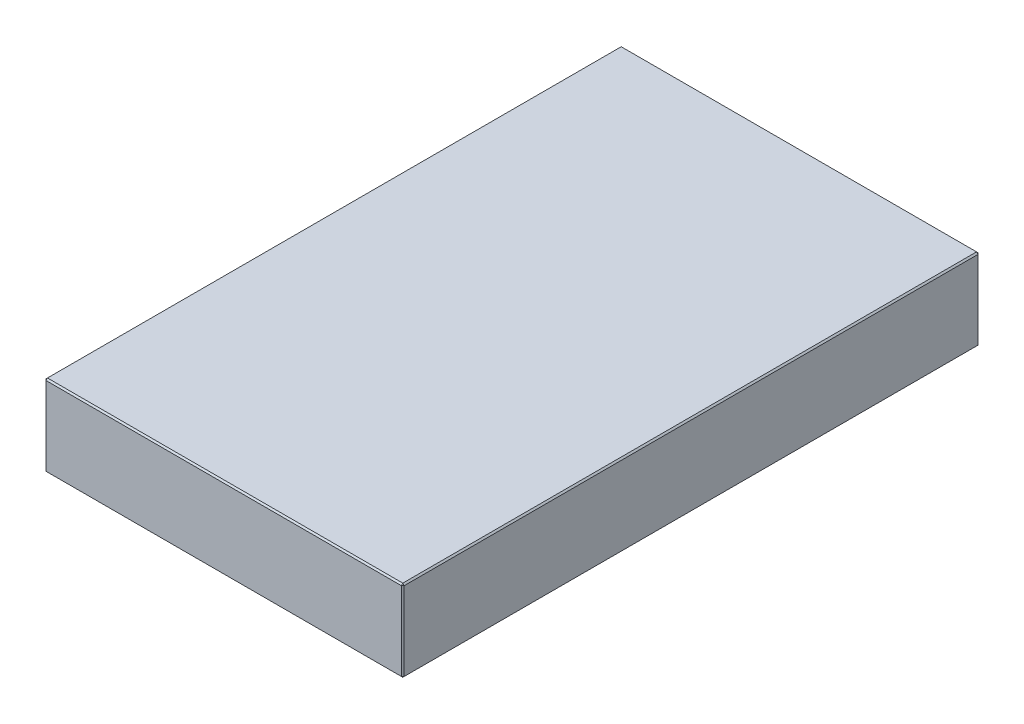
ISO-10303-21;
HEADER;
FILE_DESCRIPTION(('STEP AP214'),'2;1');
FILE_NAME('part.step','',(''),(''),'','','');
FILE_SCHEMA(('AUTOMOTIVE_DESIGN { 1 0 10303 214 1 1 1 1 }'));
ENDSEC;
DATA;
#1=APPLICATION_CONTEXT('core data for automotive mechanical design processes');
#2=APPLICATION_PROTOCOL_DEFINITION('international standard','automotive_design',2000,#1);
#3=PRODUCT_CONTEXT('',#1,'mechanical');
#4=PRODUCT('Part','Part','',(#3));
#5=PRODUCT_RELATED_PRODUCT_CATEGORY('part','',(#4));
#6=PRODUCT_DEFINITION_FORMATION('','',#4);
#7=PRODUCT_DEFINITION_CONTEXT('part definition',#1,'design');
#8=PRODUCT_DEFINITION('design','',#6,#7);
#9=PRODUCT_DEFINITION_SHAPE('','',#8);
#10=(LENGTH_UNIT() NAMED_UNIT(*) SI_UNIT(.MILLI.,.METRE.));
#11=(NAMED_UNIT(*) PLANE_ANGLE_UNIT() SI_UNIT($,.RADIAN.));
#12=(NAMED_UNIT(*) SI_UNIT($,.STERADIAN.) SOLID_ANGLE_UNIT());
#13=UNCERTAINTY_MEASURE_WITH_UNIT(LENGTH_MEASURE(1.E-05),#10,'distance_accuracy_value','');
#14=(GEOMETRIC_REPRESENTATION_CONTEXT(3) GLOBAL_UNCERTAINTY_ASSIGNED_CONTEXT((#13)) GLOBAL_UNIT_ASSIGNED_CONTEXT((#10,
#11,#12)) REPRESENTATION_CONTEXT('',''));
#15=CARTESIAN_POINT('',(0.,0.,0.));
#16=DIRECTION('',(0.,0.,1.));
#17=DIRECTION('',(1.,0.,0.));
#18=AXIS2_PLACEMENT_3D('',#15,#16,#17);
#19=CARTESIAN_POINT('',(-123.,56.,198.));
#20=DIRECTION('',(1.,0.,0.));
#21=DIRECTION('',(0.,0.,-1.));
#22=AXIS2_PLACEMENT_3D('',#19,#20,#21);
#23=PLANE('',#22);
#24=DIRECTION('',(0.,-1.,0.));
#25=VECTOR('',#24,1.);
#26=CARTESIAN_POINT('',(-123.,56.,-197.));
#27=LINE('',#26,#25);
#28=CARTESIAN_POINT('',(-123.,55.,-197.));
#29=VERTEX_POINT('',#28);
#30=CARTESIAN_POINT('',(-123.,1.00000000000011,-197.));
#31=VERTEX_POINT('',#30);
#32=EDGE_CURVE('E114',#29,#31,#27,.T.);
#33=ORIENTED_EDGE('',*,*,#32,.T.);
#34=DIRECTION('',(0.,0.,1.));
#35=VECTOR('',#34,1.);
#36=CARTESIAN_POINT('',(-123.,1.00000000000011,198.));
#37=LINE('',#36,#35);
#38=CARTESIAN_POINT('',(-123.,1.00000000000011,197.));
#39=VERTEX_POINT('',#38);
#40=EDGE_CURVE('E110',#31,#39,#37,.T.);
#41=ORIENTED_EDGE('',*,*,#40,.T.);
#42=DIRECTION('',(0.,1.,0.));
#43=VECTOR('',#42,1.);
#44=CARTESIAN_POINT('',(-123.,56.,197.));
#45=LINE('',#44,#43);
#46=CARTESIAN_POINT('',(-123.,55.,197.));
#47=VERTEX_POINT('',#46);
#48=EDGE_CURVE('E103',#39,#47,#45,.T.);
#49=ORIENTED_EDGE('',*,*,#48,.T.);
#50=DIRECTION('',(0.,0.,-1.));
#51=VECTOR('',#50,1.);
#52=CARTESIAN_POINT('',(-123.,55.,-198.));
#53=LINE('',#52,#51);
#54=EDGE_CURVE('E107',#47,#29,#53,.T.);
#55=ORIENTED_EDGE('',*,*,#54,.T.);
#56=EDGE_LOOP('',(#33,#41,#49,#55));
#57=FACE_BOUND('',#56,.T.);
#58=ADVANCED_FACE('F15',(#57),#23,.F.);
#59=CARTESIAN_POINT('',(123.,56.,198.));
#60=DIRECTION('',(0.,0.,-1.));
#61=DIRECTION('',(-1.,0.,0.));
#62=AXIS2_PLACEMENT_3D('',#59,#60,#61);
#63=PLANE('',#62);
#64=DIRECTION('',(-1.,0.,0.));
#65=VECTOR('',#64,1.);
#66=CARTESIAN_POINT('',(-123.,55.,198.));
#67=LINE('',#66,#65);
#68=CARTESIAN_POINT('',(122.,55.,198.));
#69=VERTEX_POINT('',#68);
#70=CARTESIAN_POINT('',(-122.,55.,198.));
#71=VERTEX_POINT('',#70);
#72=EDGE_CURVE('E164',#69,#71,#67,.T.);
#73=ORIENTED_EDGE('',*,*,#72,.T.);
#74=DIRECTION('',(0.,-1.,0.));
#75=VECTOR('',#74,1.);
#76=CARTESIAN_POINT('',(-122.,56.,198.));
#77=LINE('',#76,#75);
#78=CARTESIAN_POINT('',(-122.,1.00000000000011,198.));
#79=VERTEX_POINT('',#78);
#80=EDGE_CURVE('E122',#71,#79,#77,.T.);
#81=ORIENTED_EDGE('',*,*,#80,.T.);
#82=DIRECTION('',(1.,0.,0.));
#83=VECTOR('',#82,1.);
#84=CARTESIAN_POINT('',(123.,1.00000000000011,198.));
#85=LINE('',#84,#83);
#86=CARTESIAN_POINT('',(122.,1.00000000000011,198.));
#87=VERTEX_POINT('',#86);
#88=EDGE_CURVE('E168',#79,#87,#85,.T.);
#89=ORIENTED_EDGE('',*,*,#88,.T.);
#90=DIRECTION('',(0.,1.,0.));
#91=VECTOR('',#90,1.);
#92=CARTESIAN_POINT('',(122.,56.,198.));
#93=LINE('',#92,#91);
#94=EDGE_CURVE('E166',#87,#69,#93,.T.);
#95=ORIENTED_EDGE('',*,*,#94,.T.);
#96=EDGE_LOOP('',(#73,#81,#89,#95));
#97=FACE_BOUND('',#96,.T.);
#98=ADVANCED_FACE('F275',(#97),#63,.F.);
#99=CARTESIAN_POINT('',(123.,56.,198.));
#100=DIRECTION('',(-1.,0.,0.));
#101=DIRECTION('',(0.,0.,1.));
#102=AXIS2_PLACEMENT_3D('',#99,#100,#101);
#103=PLANE('',#102);
#104=DIRECTION('',(0.,0.,-1.));
#105=VECTOR('',#104,1.);
#106=CARTESIAN_POINT('',(123.,1.00000000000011,198.));
#107=LINE('',#106,#105);
#108=CARTESIAN_POINT('',(123.,1.00000000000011,197.));
#109=VERTEX_POINT('',#108);
#110=CARTESIAN_POINT('',(123.,1.00000000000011,-197.));
#111=VERTEX_POINT('',#110);
#112=EDGE_CURVE('E159',#109,#111,#107,.T.);
#113=ORIENTED_EDGE('',*,*,#112,.T.);
#114=DIRECTION('',(0.,1.,0.));
#115=VECTOR('',#114,1.);
#116=CARTESIAN_POINT('',(123.,56.,-197.));
#117=LINE('',#116,#115);
#118=CARTESIAN_POINT('',(123.,55.,-197.));
#119=VERTEX_POINT('',#118);
#120=EDGE_CURVE('E161',#111,#119,#117,.T.);
#121=ORIENTED_EDGE('',*,*,#120,.T.);
#122=DIRECTION('',(0.,0.,1.));
#123=VECTOR('',#122,1.);
#124=CARTESIAN_POINT('',(123.,55.,198.));
#125=LINE('',#124,#123);
#126=CARTESIAN_POINT('',(123.,55.,197.));
#127=VERTEX_POINT('',#126);
#128=EDGE_CURVE('E155',#119,#127,#125,.T.);
#129=ORIENTED_EDGE('',*,*,#128,.T.);
#130=DIRECTION('',(0.,-1.,0.));
#131=VECTOR('',#130,1.);
#132=CARTESIAN_POINT('',(123.,56.,197.));
#133=LINE('',#132,#131);
#134=EDGE_CURVE('E157',#127,#109,#133,.T.);
#135=ORIENTED_EDGE('',*,*,#134,.T.);
#136=EDGE_LOOP('',(#113,#121,#129,#135));
#137=FACE_BOUND('',#136,.T.);
#138=ADVANCED_FACE('F254',(#137),#103,.F.);
#139=CARTESIAN_POINT('',(123.,56.,-198.));
#140=DIRECTION('',(0.,0.,1.));
#141=DIRECTION('',(1.,0.,0.));
#142=AXIS2_PLACEMENT_3D('',#139,#140,#141);
#143=PLANE('',#142);
#144=DIRECTION('',(0.,-1.,0.));
#145=VECTOR('',#144,1.);
#146=CARTESIAN_POINT('',(122.,56.,-198.));
#147=LINE('',#146,#145);
#148=CARTESIAN_POINT('',(122.,55.,-198.));
#149=VERTEX_POINT('',#148);
#150=CARTESIAN_POINT('',(122.,1.00000000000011,-198.));
#151=VERTEX_POINT('',#150);
#152=EDGE_CURVE('E148',#149,#151,#147,.T.);
#153=ORIENTED_EDGE('',*,*,#152,.T.);
#154=DIRECTION('',(-1.,0.,0.));
#155=VECTOR('',#154,1.);
#156=CARTESIAN_POINT('',(123.,1.00000000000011,-198.));
#157=LINE('',#156,#155);
#158=CARTESIAN_POINT('',(-122.,1.00000000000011,-198.));
#159=VERTEX_POINT('',#158);
#160=EDGE_CURVE('E153',#151,#159,#157,.T.);
#161=ORIENTED_EDGE('',*,*,#160,.T.);
#162=DIRECTION('',(0.,1.,0.));
#163=VECTOR('',#162,1.);
#164=CARTESIAN_POINT('',(-122.,56.,-198.));
#165=LINE('',#164,#163);
#166=CARTESIAN_POINT('',(-122.,55.,-198.));
#167=VERTEX_POINT('',#166);
#168=EDGE_CURVE('E150',#159,#167,#165,.T.);
#169=ORIENTED_EDGE('',*,*,#168,.T.);
#170=DIRECTION('',(1.,0.,0.));
#171=VECTOR('',#170,1.);
#172=CARTESIAN_POINT('',(123.,55.,-198.));
#173=LINE('',#172,#171);
#174=EDGE_CURVE('E146',#167,#149,#173,.T.);
#175=ORIENTED_EDGE('',*,*,#174,.T.);
#176=EDGE_LOOP('',(#153,#161,#169,#175));
#177=FACE_BOUND('',#176,.T.);
#178=ADVANCED_FACE('F284',(#177),#143,.F.);
#179=CARTESIAN_POINT('',(0.,56.,0.));
#180=DIRECTION('',(0.,1.,0.));
#181=DIRECTION('',(0.,0.,1.));
#182=AXIS2_PLACEMENT_3D('',#179,#180,#181);
#183=PLANE('',#182);
#184=DIRECTION('',(0.,0.,-1.));
#185=VECTOR('',#184,1.);
#186=CARTESIAN_POINT('',(122.,56.,-198.));
#187=LINE('',#186,#185);
#188=CARTESIAN_POINT('',(122.,56.,197.));
#189=VERTEX_POINT('',#188);
#190=CARTESIAN_POINT('',(122.,56.,-197.));
#191=VERTEX_POINT('',#190);
#192=EDGE_CURVE('E24',#189,#191,#187,.T.);
#193=ORIENTED_EDGE('',*,*,#192,.T.);
#194=DIRECTION('',(-1.,0.,0.));
#195=VECTOR('',#194,1.);
#196=CARTESIAN_POINT('',(-123.,56.,-197.));
#197=LINE('',#196,#195);
#198=CARTESIAN_POINT('',(-122.,56.,-197.));
#199=VERTEX_POINT('',#198);
#200=EDGE_CURVE('E9',#191,#199,#197,.T.);
#201=ORIENTED_EDGE('',*,*,#200,.T.);
#202=DIRECTION('',(0.,0.,1.));
#203=VECTOR('',#202,1.);
#204=CARTESIAN_POINT('',(-122.,56.,198.));
#205=LINE('',#204,#203);
#206=CARTESIAN_POINT('',(-122.,56.,197.));
#207=VERTEX_POINT('',#206);
#208=EDGE_CURVE('E180',#199,#207,#205,.T.);
#209=ORIENTED_EDGE('',*,*,#208,.T.);
#210=DIRECTION('',(1.,0.,0.));
#211=VECTOR('',#210,1.);
#212=CARTESIAN_POINT('',(123.,56.,197.));
#213=LINE('',#212,#211);
#214=EDGE_CURVE('E35',#207,#189,#213,.T.);
#215=ORIENTED_EDGE('',*,*,#214,.T.);
#216=EDGE_LOOP('',(#193,#201,#209,#215));
#217=FACE_BOUND('',#216,.T.);
#218=ADVANCED_FACE('F350',(#217),#183,.T.);
#219=CARTESIAN_POINT('',(0.,0.,0.));
#220=DIRECTION('',(0.,1.,0.));
#221=DIRECTION('',(0.,0.,1.));
#222=AXIS2_PLACEMENT_3D('',#219,#220,#221);
#223=PLANE('',#222);
#224=DIRECTION('',(0.,0.,1.));
#225=VECTOR('',#224,1.);
#226=CARTESIAN_POINT('',(122.,0.,0.));
#227=LINE('',#226,#225);
#228=CARTESIAN_POINT('',(122.,0.,-197.));
#229=VERTEX_POINT('',#228);
#230=CARTESIAN_POINT('',(122.,0.,197.));
#231=VERTEX_POINT('',#230);
#232=EDGE_CURVE('E171',#229,#231,#227,.T.);
#233=ORIENTED_EDGE('',*,*,#232,.T.);
#234=DIRECTION('',(-1.,0.,0.));
#235=VECTOR('',#234,1.);
#236=CARTESIAN_POINT('',(0.,0.,197.));
#237=LINE('',#236,#235);
#238=CARTESIAN_POINT('',(-122.,0.,197.));
#239=VERTEX_POINT('',#238);
#240=EDGE_CURVE('E177',#231,#239,#237,.T.);
#241=ORIENTED_EDGE('',*,*,#240,.T.);
#242=DIRECTION('',(0.,0.,-1.));
#243=VECTOR('',#242,1.);
#244=CARTESIAN_POINT('',(-122.,0.,0.));
#245=LINE('',#244,#243);
#246=CARTESIAN_POINT('',(-122.,0.,-197.));
#247=VERTEX_POINT('',#246);
#248=EDGE_CURVE('E175',#239,#247,#245,.T.);
#249=ORIENTED_EDGE('',*,*,#248,.T.);
#250=DIRECTION('',(1.,0.,0.));
#251=VECTOR('',#250,1.);
#252=CARTESIAN_POINT('',(0.,0.,-197.));
#253=LINE('',#252,#251);
#254=EDGE_CURVE('E173',#247,#229,#253,.T.);
#255=ORIENTED_EDGE('',*,*,#254,.T.);
#256=EDGE_LOOP('',(#233,#241,#249,#255));
#257=FACE_BOUND('',#256,.T.);
#258=ADVANCED_FACE('F246',(#257),#223,.F.);
#259=CARTESIAN_POINT('',(123.,56.,197.));
#260=DIRECTION('',(-0.707106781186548,0.,-0.707106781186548));
#261=DIRECTION('',(0.,-1.,0.));
#262=AXIS2_PLACEMENT_3D('',#259,#260,#261);
#263=PLANE('',#262);
#264=DIRECTION('',(-0.707106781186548,0.,0.707106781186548));
#265=VECTOR('',#264,1.);
#266=CARTESIAN_POINT('',(122.,55.,198.));
#267=LINE('',#266,#265);
#268=EDGE_CURVE('E19',#69,#127,#267,.F.);
#269=ORIENTED_EDGE('',*,*,#268,.F.);
#270=ORIENTED_EDGE('',*,*,#94,.F.);
#271=DIRECTION('',(0.707106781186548,0.,-0.707106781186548));
#272=VECTOR('',#271,1.);
#273=CARTESIAN_POINT('',(122.,1.00000000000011,198.));
#274=LINE('',#273,#272);
#275=EDGE_CURVE('E142',#109,#87,#274,.F.);
#276=ORIENTED_EDGE('',*,*,#275,.F.);
#277=ORIENTED_EDGE('',*,*,#134,.F.);
#278=EDGE_LOOP('',(#269,#270,#276,#277));
#279=FACE_BOUND('',#278,.T.);
#280=ADVANCED_FACE('F17',(#279),#263,.F.);
#281=CARTESIAN_POINT('',(122.,55.,198.));
#282=DIRECTION('',(0.577350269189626,0.577350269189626,0.577350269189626));
#283=DIRECTION('',(0.707106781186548,0.,-0.707106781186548));
#284=AXIS2_PLACEMENT_3D('',#281,#282,#283);
#285=PLANE('',#284);
#286=DIRECTION('',(0.,-0.707106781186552,0.707106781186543));
#287=VECTOR('',#286,1.);
#288=CARTESIAN_POINT('',(122.,55.,198.));
#289=LINE('',#288,#287);
#290=EDGE_CURVE('E226',#69,#189,#289,.F.);
#291=ORIENTED_EDGE('',*,*,#290,.F.);
#292=ORIENTED_EDGE('',*,*,#268,.T.);
#293=DIRECTION('',(-0.707106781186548,0.707106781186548,0.));
#294=VECTOR('',#293,1.);
#295=CARTESIAN_POINT('',(122.5,55.5,197.));
#296=LINE('',#295,#294);
#297=EDGE_CURVE('E228',#189,#127,#296,.F.);
#298=ORIENTED_EDGE('',*,*,#297,.F.);
#299=EDGE_LOOP('',(#291,#292,#298));
#300=FACE_BOUND('',#299,.T.);
#301=ADVANCED_FACE('F270',(#300),#285,.T.);
#302=CARTESIAN_POINT('',(122.,1.00000000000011,198.));
#303=DIRECTION('',(0.577350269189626,-0.577350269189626,0.577350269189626));
#304=DIRECTION('',(0.707106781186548,0.,-0.707106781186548));
#305=AXIS2_PLACEMENT_3D('',#302,#303,#304);
#306=PLANE('',#305);
#307=DIRECTION('',(-0.707106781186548,-0.707106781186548,0.));
#308=VECTOR('',#307,1.);
#309=CARTESIAN_POINT('',(122.5,0.500000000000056,197.));
#310=LINE('',#309,#308);
#311=EDGE_CURVE('E220',#109,#231,#310,.T.);
#312=ORIENTED_EDGE('',*,*,#311,.F.);
#313=ORIENTED_EDGE('',*,*,#275,.T.);
#314=DIRECTION('',(0.,0.707106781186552,0.707106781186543));
#315=VECTOR('',#314,1.);
#316=CARTESIAN_POINT('',(122.,1.00000000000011,198.));
#317=LINE('',#316,#315);
#318=EDGE_CURVE('E223',#231,#87,#317,.T.);
#319=ORIENTED_EDGE('',*,*,#318,.F.);
#320=EDGE_LOOP('',(#312,#313,#319));
#321=FACE_BOUND('',#320,.T.);
#322=ADVANCED_FACE('F235',(#321),#306,.T.);
#323=CARTESIAN_POINT('',(122.,56.,0.));
#324=DIRECTION('',(0.707106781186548,0.707106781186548,0.));
#325=DIRECTION('',(0.,0.,1.));
#326=AXIS2_PLACEMENT_3D('',#323,#324,#325);
#327=PLANE('',#326);
#328=ORIENTED_EDGE('',*,*,#297,.T.);
#329=ORIENTED_EDGE('',*,*,#128,.F.);
#330=DIRECTION('',(0.707106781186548,-0.707106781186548,0.));
#331=VECTOR('',#330,1.);
#332=CARTESIAN_POINT('',(123.,55.,-197.));
#333=LINE('',#332,#331);
#334=EDGE_CURVE('E215',#191,#119,#333,.T.);
#335=ORIENTED_EDGE('',*,*,#334,.F.);
#336=ORIENTED_EDGE('',*,*,#192,.F.);
#337=EDGE_LOOP('',(#328,#329,#335,#336));
#338=FACE_BOUND('',#337,.T.);
#339=ADVANCED_FACE('F265',(#338),#327,.T.);
#340=CARTESIAN_POINT('',(0.,56.,197.));
#341=DIRECTION('',(0.,0.707106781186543,0.707106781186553));
#342=DIRECTION('',(-1.,0.,0.));
#343=AXIS2_PLACEMENT_3D('',#340,#341,#342);
#344=PLANE('',#343);
#345=ORIENTED_EDGE('',*,*,#290,.T.);
#346=ORIENTED_EDGE('',*,*,#214,.F.);
#347=DIRECTION('',(0.,0.707106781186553,-0.707106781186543));
#348=VECTOR('',#347,1.);
#349=CARTESIAN_POINT('',(-122.,55.5,197.5));
#350=LINE('',#349,#348);
#351=EDGE_CURVE('E126',#71,#207,#350,.T.);
#352=ORIENTED_EDGE('',*,*,#351,.F.);
#353=ORIENTED_EDGE('',*,*,#72,.F.);
#354=EDGE_LOOP('',(#345,#346,#352,#353));
#355=FACE_BOUND('',#354,.T.);
#356=ADVANCED_FACE('F273',(#355),#344,.T.);
#357=CARTESIAN_POINT('',(-122.,56.,198.));
#358=DIRECTION('',(0.707106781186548,0.,-0.707106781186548));
#359=DIRECTION('',(0.,-1.,0.));
#360=AXIS2_PLACEMENT_3D('',#357,#358,#359);
#361=PLANE('',#360);
#362=DIRECTION('',(0.707106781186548,0.,0.707106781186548));
#363=VECTOR('',#362,1.);
#364=CARTESIAN_POINT('',(-122.,1.00000000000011,198.));
#365=LINE('',#364,#363);
#366=EDGE_CURVE('E127',#79,#39,#365,.F.);
#367=ORIENTED_EDGE('',*,*,#366,.F.);
#368=ORIENTED_EDGE('',*,*,#80,.F.);
#369=DIRECTION('',(-0.707106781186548,0.,-0.707106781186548));
#370=VECTOR('',#369,1.);
#371=CARTESIAN_POINT('',(-123.,55.,197.));
#372=LINE('',#371,#370);
#373=EDGE_CURVE('E118',#47,#71,#372,.F.);
#374=ORIENTED_EDGE('',*,*,#373,.F.);
#375=ORIENTED_EDGE('',*,*,#48,.F.);
#376=EDGE_LOOP('',(#367,#368,#374,#375));
#377=FACE_BOUND('',#376,.T.);
#378=ADVANCED_FACE('F120',(#377),#361,.F.);
#379=CARTESIAN_POINT('',(123.,1.00000000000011,198.));
#380=DIRECTION('',(0.,0.707106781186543,-0.707106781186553));
#381=DIRECTION('',(1.,0.,0.));
#382=AXIS2_PLACEMENT_3D('',#379,#380,#381);
#383=PLANE('',#382);
#384=ORIENTED_EDGE('',*,*,#318,.T.);
#385=ORIENTED_EDGE('',*,*,#88,.F.);
#386=DIRECTION('',(0.,-0.707106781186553,-0.707106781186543));
#387=VECTOR('',#386,1.);
#388=CARTESIAN_POINT('',(-122.,1.00000000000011,198.));
#389=LINE('',#388,#387);
#390=EDGE_CURVE('E211',#239,#79,#389,.F.);
#391=ORIENTED_EDGE('',*,*,#390,.F.);
#392=ORIENTED_EDGE('',*,*,#240,.F.);
#393=EDGE_LOOP('',(#384,#385,#391,#392));
#394=FACE_BOUND('',#393,.T.);
#395=ADVANCED_FACE('F243',(#394),#383,.F.);
#396=CARTESIAN_POINT('',(123.,1.00000000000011,198.));
#397=DIRECTION('',(-0.707106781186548,0.707106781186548,0.));
#398=DIRECTION('',(0.,0.,-1.));
#399=AXIS2_PLACEMENT_3D('',#396,#397,#398);
#400=PLANE('',#399);
#401=ORIENTED_EDGE('',*,*,#311,.T.);
#402=ORIENTED_EDGE('',*,*,#232,.F.);
#403=DIRECTION('',(0.707106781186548,0.707106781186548,0.));
#404=VECTOR('',#403,1.);
#405=CARTESIAN_POINT('',(122.5,0.500000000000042,-197.));
#406=LINE('',#405,#404);
#407=EDGE_CURVE('E208',#111,#229,#406,.F.);
#408=ORIENTED_EDGE('',*,*,#407,.F.);
#409=ORIENTED_EDGE('',*,*,#112,.F.);
#410=EDGE_LOOP('',(#401,#402,#408,#409));
#411=FACE_BOUND('',#410,.T.);
#412=ADVANCED_FACE('F251',(#411),#400,.F.);
#413=CARTESIAN_POINT('',(122.,56.,-198.));
#414=DIRECTION('',(-0.707106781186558,0.,0.707106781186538));
#415=DIRECTION('',(0.,-1.,0.));
#416=AXIS2_PLACEMENT_3D('',#413,#414,#415);
#417=PLANE('',#416);
#418=DIRECTION('',(0.707106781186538,0.,0.707106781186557));
#419=VECTOR('',#418,1.);
#420=CARTESIAN_POINT('',(123.,55.,-197.));
#421=LINE('',#420,#419);
#422=EDGE_CURVE('E217',#119,#149,#421,.F.);
#423=ORIENTED_EDGE('',*,*,#422,.F.);
#424=ORIENTED_EDGE('',*,*,#120,.F.);
#425=DIRECTION('',(-0.707106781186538,0.,-0.707106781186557));
#426=VECTOR('',#425,1.);
#427=CARTESIAN_POINT('',(122.,1.00000000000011,-198.));
#428=LINE('',#427,#426);
#429=EDGE_CURVE('E205',#151,#111,#428,.F.);
#430=ORIENTED_EDGE('',*,*,#429,.F.);
#431=ORIENTED_EDGE('',*,*,#152,.F.);
#432=EDGE_LOOP('',(#423,#424,#430,#431));
#433=FACE_BOUND('',#432,.T.);
#434=ADVANCED_FACE('F258',(#433),#417,.F.);
#435=CARTESIAN_POINT('',(123.,55.,-197.));
#436=DIRECTION('',(0.577350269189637,0.577350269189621,-0.577350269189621));
#437=DIRECTION('',(-0.707106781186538,0.,-0.707106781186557));
#438=AXIS2_PLACEMENT_3D('',#435,#436,#437);
#439=PLANE('',#438);
#440=ORIENTED_EDGE('',*,*,#334,.T.);
#441=ORIENTED_EDGE('',*,*,#422,.T.);
#442=DIRECTION('',(0.,0.707106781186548,0.707106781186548));
#443=VECTOR('',#442,1.);
#444=CARTESIAN_POINT('',(122.,55.5,-197.5));
#445=LINE('',#444,#443);
#446=EDGE_CURVE('E134',#191,#149,#445,.F.);
#447=ORIENTED_EDGE('',*,*,#446,.F.);
#448=EDGE_LOOP('',(#440,#441,#447));
#449=FACE_BOUND('',#448,.T.);
#450=ADVANCED_FACE('F325',(#449),#439,.T.);
#451=CARTESIAN_POINT('',(-123.,55.,197.));
#452=DIRECTION('',(-0.577350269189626,0.577350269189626,0.577350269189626));
#453=DIRECTION('',(0.707106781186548,0.,0.707106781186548));
#454=AXIS2_PLACEMENT_3D('',#451,#452,#453);
#455=PLANE('',#454);
#456=ORIENTED_EDGE('',*,*,#373,.T.);
#457=ORIENTED_EDGE('',*,*,#351,.T.);
#458=DIRECTION('',(-0.707106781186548,-0.707106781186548,0.));
#459=VECTOR('',#458,1.);
#460=CARTESIAN_POINT('',(-123.,55.,197.));
#461=LINE('',#460,#459);
#462=EDGE_CURVE('E130',#47,#207,#461,.F.);
#463=ORIENTED_EDGE('',*,*,#462,.F.);
#464=EDGE_LOOP('',(#456,#457,#463));
#465=FACE_BOUND('',#464,.T.);
#466=ADVANCED_FACE('F131',(#465),#455,.T.);
#467=CARTESIAN_POINT('',(-122.,1.00000000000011,198.));
#468=DIRECTION('',(-0.577350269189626,-0.577350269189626,0.577350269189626));
#469=DIRECTION('',(0.707106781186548,0.,0.707106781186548));
#470=AXIS2_PLACEMENT_3D('',#467,#468,#469);
#471=PLANE('',#470);
#472=ORIENTED_EDGE('',*,*,#390,.T.);
#473=ORIENTED_EDGE('',*,*,#366,.T.);
#474=DIRECTION('',(-0.707106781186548,0.707106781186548,0.));
#475=VECTOR('',#474,1.);
#476=CARTESIAN_POINT('',(-122.5,0.500000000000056,197.));
#477=LINE('',#476,#475);
#478=EDGE_CURVE('E135',#239,#39,#477,.T.);
#479=ORIENTED_EDGE('',*,*,#478,.F.);
#480=EDGE_LOOP('',(#472,#473,#479));
#481=FACE_BOUND('',#480,.T.);
#482=ADVANCED_FACE('F318',(#481),#471,.T.);
#483=CARTESIAN_POINT('',(122.,1.00000000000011,-198.));
#484=DIRECTION('',(0.577350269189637,-0.577350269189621,-0.577350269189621));
#485=DIRECTION('',(-0.707106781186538,0.,-0.707106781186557));
#486=AXIS2_PLACEMENT_3D('',#483,#484,#485);
#487=PLANE('',#486);
#488=ORIENTED_EDGE('',*,*,#429,.T.);
#489=ORIENTED_EDGE('',*,*,#407,.T.);
#490=DIRECTION('',(0.,-0.707106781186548,0.707106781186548));
#491=VECTOR('',#490,1.);
#492=CARTESIAN_POINT('',(122.,1.00000000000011,-198.));
#493=LINE('',#492,#491);
#494=EDGE_CURVE('E198',#151,#229,#493,.T.);
#495=ORIENTED_EDGE('',*,*,#494,.F.);
#496=EDGE_LOOP('',(#488,#489,#495));
#497=FACE_BOUND('',#496,.T.);
#498=ADVANCED_FACE('F314',(#497),#487,.T.);
#499=CARTESIAN_POINT('',(0.,56.,-197.));
#500=DIRECTION('',(0.,0.707106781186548,-0.707106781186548));
#501=DIRECTION('',(1.,0.,0.));
#502=AXIS2_PLACEMENT_3D('',#499,#500,#501);
#503=PLANE('',#502);
#504=ORIENTED_EDGE('',*,*,#446,.T.);
#505=ORIENTED_EDGE('',*,*,#174,.F.);
#506=DIRECTION('',(0.,-0.707106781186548,-0.707106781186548));
#507=VECTOR('',#506,1.);
#508=CARTESIAN_POINT('',(-122.,55.,-198.));
#509=LINE('',#508,#507);
#510=EDGE_CURVE('E195',#199,#167,#509,.T.);
#511=ORIENTED_EDGE('',*,*,#510,.F.);
#512=ORIENTED_EDGE('',*,*,#200,.F.);
#513=EDGE_LOOP('',(#504,#505,#511,#512));
#514=FACE_BOUND('',#513,.T.);
#515=ADVANCED_FACE('F311',(#514),#503,.T.);
#516=CARTESIAN_POINT('',(-122.,56.,0.));
#517=DIRECTION('',(-0.707106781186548,0.707106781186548,0.));
#518=DIRECTION('',(0.,0.,-1.));
#519=AXIS2_PLACEMENT_3D('',#516,#517,#518);
#520=PLANE('',#519);
#521=ORIENTED_EDGE('',*,*,#462,.T.);
#522=ORIENTED_EDGE('',*,*,#208,.F.);
#523=DIRECTION('',(0.707106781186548,0.707106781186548,0.));
#524=VECTOR('',#523,1.);
#525=CARTESIAN_POINT('',(-122.5,55.5,-197.));
#526=LINE('',#525,#524);
#527=EDGE_CURVE('E138',#29,#199,#526,.T.);
#528=ORIENTED_EDGE('',*,*,#527,.F.);
#529=ORIENTED_EDGE('',*,*,#54,.F.);
#530=EDGE_LOOP('',(#521,#522,#528,#529));
#531=FACE_BOUND('',#530,.T.);
#532=ADVANCED_FACE('F137',(#531),#520,.T.);
#533=CARTESIAN_POINT('',(-123.,1.00000000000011,198.));
#534=DIRECTION('',(0.707106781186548,0.707106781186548,0.));
#535=DIRECTION('',(0.,0.,1.));
#536=AXIS2_PLACEMENT_3D('',#533,#534,#535);
#537=PLANE('',#536);
#538=ORIENTED_EDGE('',*,*,#478,.T.);
#539=ORIENTED_EDGE('',*,*,#40,.F.);
#540=DIRECTION('',(0.707106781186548,-0.707106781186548,0.));
#541=VECTOR('',#540,1.);
#542=CARTESIAN_POINT('',(-123.,1.00000000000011,-197.));
#543=LINE('',#542,#541);
#544=EDGE_CURVE('E191',#247,#31,#543,.F.);
#545=ORIENTED_EDGE('',*,*,#544,.F.);
#546=ORIENTED_EDGE('',*,*,#248,.F.);
#547=EDGE_LOOP('',(#538,#539,#545,#546));
#548=FACE_BOUND('',#547,.T.);
#549=ADVANCED_FACE('F304',(#548),#537,.F.);
#550=CARTESIAN_POINT('',(123.,1.00000000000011,-198.));
#551=DIRECTION('',(0.,0.707106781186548,0.707106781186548));
#552=DIRECTION('',(-1.,0.,0.));
#553=AXIS2_PLACEMENT_3D('',#550,#551,#552);
#554=PLANE('',#553);
#555=ORIENTED_EDGE('',*,*,#494,.T.);
#556=ORIENTED_EDGE('',*,*,#254,.F.);
#557=DIRECTION('',(0.,0.707106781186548,-0.707106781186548));
#558=VECTOR('',#557,1.);
#559=CARTESIAN_POINT('',(-122.,0.500000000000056,-197.5));
#560=LINE('',#559,#558);
#561=EDGE_CURVE('E188',#159,#247,#560,.F.);
#562=ORIENTED_EDGE('',*,*,#561,.F.);
#563=ORIENTED_EDGE('',*,*,#160,.F.);
#564=EDGE_LOOP('',(#555,#556,#562,#563));
#565=FACE_BOUND('',#564,.T.);
#566=ADVANCED_FACE('F300',(#565),#554,.F.);
#567=CARTESIAN_POINT('',(-122.,55.,-198.));
#568=DIRECTION('',(-0.577350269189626,0.577350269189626,-0.577350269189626));
#569=DIRECTION('',(-0.707106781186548,0.,0.707106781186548));
#570=AXIS2_PLACEMENT_3D('',#567,#568,#569);
#571=PLANE('',#570);
#572=ORIENTED_EDGE('',*,*,#527,.T.);
#573=ORIENTED_EDGE('',*,*,#510,.T.);
#574=DIRECTION('',(0.707106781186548,0.,-0.707106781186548));
#575=VECTOR('',#574,1.);
#576=CARTESIAN_POINT('',(-122.,55.,-198.));
#577=LINE('',#576,#575);
#578=EDGE_CURVE('E186',#29,#167,#577,.T.);
#579=ORIENTED_EDGE('',*,*,#578,.F.);
#580=EDGE_LOOP('',(#572,#573,#579));
#581=FACE_BOUND('',#580,.T.);
#582=ADVANCED_FACE('F296',(#581),#571,.T.);
#583=CARTESIAN_POINT('',(-123.,1.00000000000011,-197.));
#584=DIRECTION('',(-0.577350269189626,-0.577350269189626,-0.577350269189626));
#585=DIRECTION('',(-0.707106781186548,0.,0.707106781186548));
#586=AXIS2_PLACEMENT_3D('',#583,#584,#585);
#587=PLANE('',#586);
#588=ORIENTED_EDGE('',*,*,#561,.T.);
#589=ORIENTED_EDGE('',*,*,#544,.T.);
#590=DIRECTION('',(-0.707106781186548,0.,0.707106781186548));
#591=VECTOR('',#590,1.);
#592=CARTESIAN_POINT('',(-123.,1.00000000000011,-197.));
#593=LINE('',#592,#591);
#594=EDGE_CURVE('E184',#159,#31,#593,.T.);
#595=ORIENTED_EDGE('',*,*,#594,.F.);
#596=EDGE_LOOP('',(#588,#589,#595));
#597=FACE_BOUND('',#596,.T.);
#598=ADVANCED_FACE('F292',(#597),#587,.T.);
#599=CARTESIAN_POINT('',(-123.,56.,-197.));
#600=DIRECTION('',(0.707106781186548,0.,0.707106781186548));
#601=DIRECTION('',(0.,-1.,0.));
#602=AXIS2_PLACEMENT_3D('',#599,#600,#601);
#603=PLANE('',#602);
#604=ORIENTED_EDGE('',*,*,#578,.T.);
#605=ORIENTED_EDGE('',*,*,#168,.F.);
#606=ORIENTED_EDGE('',*,*,#594,.T.);
#607=ORIENTED_EDGE('',*,*,#32,.F.);
#608=EDGE_LOOP('',(#604,#605,#606,#607));
#609=FACE_BOUND('',#608,.T.);
#610=ADVANCED_FACE('F289',(#609),#603,.F.);
#611=CLOSED_SHELL('',(#58,#98,#138,#178,#218,#258,#280,#301,#322,#339,#356,#378,#395,#412,#434,
#450,#466,#482,#498,#515,#532,#549,#566,#582,#598,#610));
#612=MANIFOLD_SOLID_BREP('B1',#611);
#613=ADVANCED_BREP_SHAPE_REPRESENTATION('',(#18,#612),#14);
#614=SHAPE_DEFINITION_REPRESENTATION(#9,#613);
ENDSEC;
END-ISO-10303-21;
